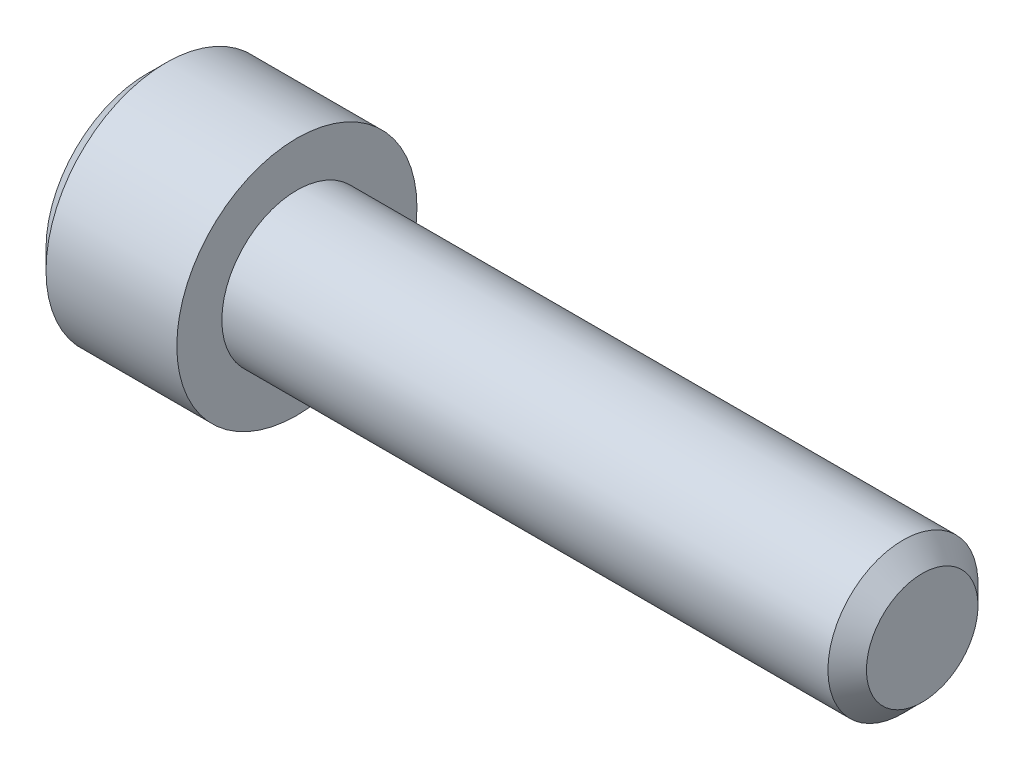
from build123d import *

# Parameters (mm, degrees)
CUT_EXTRUDE1_DEPTH = 0.635


with BuildPart() as part:
    # Sketch1 → Base-Revolve (revolve)
    with BuildSketch(Plane.XY, mode=Mode.PRIVATE) as base_revolve_sk:
        Polygon((0, 0.762), (6.15442, 0.762), (6.35, 0.56642), (6.35, 0), (-1.524, 0), (-1.524, 1.02362), (-1.32842, 1.2192), (0, 1.2192), align=None)
    revolve(base_revolve_sk.sketch.rotate(Axis((-51.524, 0, 0), (1, 0, 0)), 90), axis=Axis((-51.524, 0, 0), (1, 0, 0)))

    # Sketch3 → Cut-Extrude1 (cut)
    with BuildSketch(Plane.ZY.offset(1.524)):
        Polygon((-0.366617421, 0.635), (0.366617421, 0.635), (0.733234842, 0), (0.366617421, -0.635), (-0.366617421, -0.635), (-0.733234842, 0), align=None)
    extrude(amount=-CUT_EXTRUDE1_DEPTH, mode=Mode.SUBTRACT)


solid = part.part
